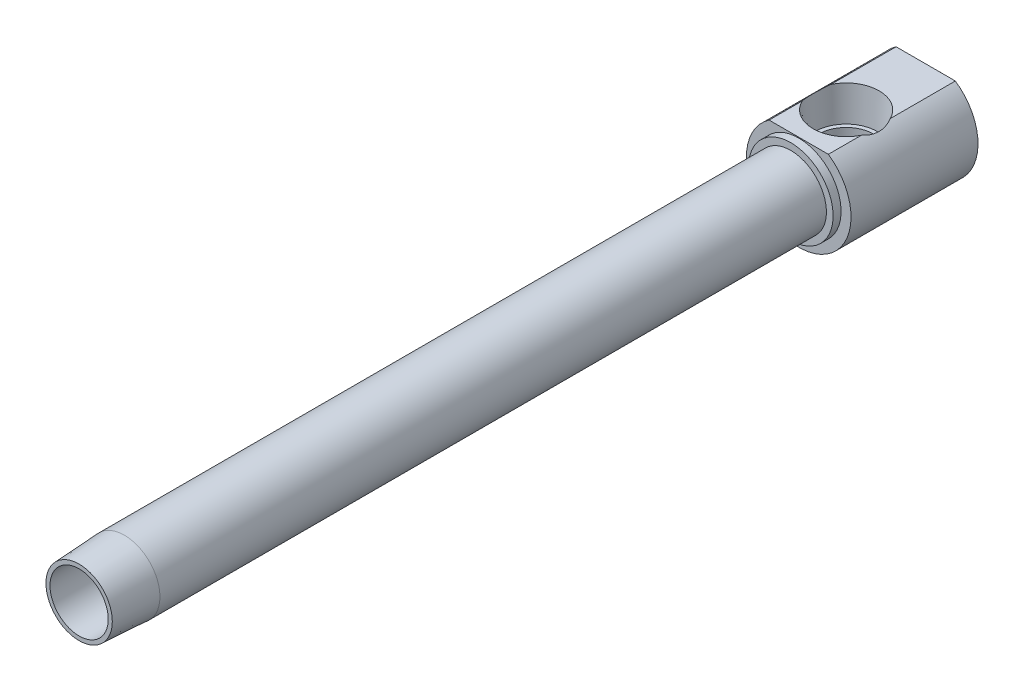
ISO-10303-21;
HEADER;
FILE_DESCRIPTION(('STEP AP214'),'2;1');
FILE_NAME('part.step','',(''),(''),'','','');
FILE_SCHEMA(('AUTOMOTIVE_DESIGN { 1 0 10303 214 1 1 1 1 }'));
ENDSEC;
DATA;
#1=APPLICATION_CONTEXT('core data for automotive mechanical design processes');
#2=APPLICATION_PROTOCOL_DEFINITION('international standard','automotive_design',2000,#1);
#3=PRODUCT_CONTEXT('',#1,'mechanical');
#4=PRODUCT('Part','Part','',(#3));
#5=PRODUCT_RELATED_PRODUCT_CATEGORY('part','',(#4));
#6=PRODUCT_DEFINITION_FORMATION('','',#4);
#7=PRODUCT_DEFINITION_CONTEXT('part definition',#1,'design');
#8=PRODUCT_DEFINITION('design','',#6,#7);
#9=PRODUCT_DEFINITION_SHAPE('','',#8);
#10=(LENGTH_UNIT() NAMED_UNIT(*) SI_UNIT(.MILLI.,.METRE.));
#11=(NAMED_UNIT(*) PLANE_ANGLE_UNIT() SI_UNIT($,.RADIAN.));
#12=(NAMED_UNIT(*) SI_UNIT($,.STERADIAN.) SOLID_ANGLE_UNIT());
#13=UNCERTAINTY_MEASURE_WITH_UNIT(LENGTH_MEASURE(1.E-05),#10,'distance_accuracy_value','');
#14=(GEOMETRIC_REPRESENTATION_CONTEXT(3) GLOBAL_UNCERTAINTY_ASSIGNED_CONTEXT((#13)) GLOBAL_UNIT_ASSIGNED_CONTEXT((#10,
#11,#12)) REPRESENTATION_CONTEXT('',''));
#15=CARTESIAN_POINT('',(0.,0.,0.));
#16=DIRECTION('',(0.,0.,1.));
#17=DIRECTION('',(1.,0.,0.));
#18=AXIS2_PLACEMENT_3D('',#15,#16,#17);
#19=CARTESIAN_POINT('',(0.,0.,-272.047166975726));
#20=DIRECTION('',(0.,0.,-1.));
#21=DIRECTION('',(-1.,0.,0.));
#22=AXIS2_PLACEMENT_3D('',#19,#20,#21);
#23=CYLINDRICAL_SURFACE('',#22,10.6883167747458);
#24=CARTESIAN_POINT('',(0.,0.,-213.5124));
#25=DIRECTION('',(0.,0.,-1.));
#26=DIRECTION('',(-1.,0.,0.));
#27=AXIS2_PLACEMENT_3D('',#24,#25,#26);
#28=CIRCLE('',#27,10.6883167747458);
#29=CARTESIAN_POINT('',(-10.6883167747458,0.,-213.5124));
#30=VERTEX_POINT('',#29);
#31=EDGE_CURVE('E143',#30,#30,#28,.T.);
#32=ORIENTED_EDGE('',*,*,#31,.F.);
#33=EDGE_LOOP('',(#32));
#34=FACE_BOUND('',#33,.T.);
#35=CARTESIAN_POINT('',(0.,0.,-13.5636));
#36=DIRECTION('',(0.,0.,1.));
#37=DIRECTION('',(1.,0.,0.));
#38=AXIS2_PLACEMENT_3D('',#35,#36,#37);
#39=CIRCLE('',#38,10.6883167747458);
#40=CARTESIAN_POINT('',(10.6883167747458,0.,-13.5636));
#41=VERTEX_POINT('',#40);
#42=EDGE_CURVE('E228',#41,#41,#39,.T.);
#43=ORIENTED_EDGE('',*,*,#42,.F.);
#44=EDGE_LOOP('',(#43));
#45=FACE_BOUND('',#44,.T.);
#46=ADVANCED_FACE('F15',(#34,#45),#23,.T.);
#47=CARTESIAN_POINT('',(-8.73125000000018,0.,0.));
#48=DIRECTION('',(0.,0.,1.));
#49=DIRECTION('',(1.,0.,0.));
#50=AXIS2_PLACEMENT_3D('',#47,#48,#49);
#51=PLANE('',#50);
#52=CARTESIAN_POINT('',(0.,0.,0.));
#53=DIRECTION('',(0.,0.,-1.));
#54=DIRECTION('',(-1.,0.,0.));
#55=AXIS2_PLACEMENT_3D('',#52,#53,#54);
#56=CIRCLE('',#55,8.73125000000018);
#57=CARTESIAN_POINT('',(-8.73125000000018,0.,0.));
#58=VERTEX_POINT('',#57);
#59=EDGE_CURVE('E19',#58,#58,#56,.T.);
#60=ORIENTED_EDGE('',*,*,#59,.T.);
#61=EDGE_LOOP('',(#60));
#62=FACE_BOUND('',#61,.T.);
#63=CARTESIAN_POINT('',(0.,0.,0.));
#64=DIRECTION('',(0.,0.,1.));
#65=DIRECTION('',(1.,0.,0.));
#66=AXIS2_PLACEMENT_3D('',#63,#64,#65);
#67=CIRCLE('',#66,9.9568);
#68=CARTESIAN_POINT('',(9.9568,0.,0.));
#69=VERTEX_POINT('',#68);
#70=EDGE_CURVE('E230',#69,#69,#67,.T.);
#71=ORIENTED_EDGE('',*,*,#70,.T.);
#72=EDGE_LOOP('',(#71));
#73=FACE_BOUND('',#72,.T.);
#74=ADVANCED_FACE('F17',(#62,#73),#51,.T.);
#75=CARTESIAN_POINT('',(-8.89,12.9217429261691,-196.85));
#76=DIRECTION('',(0.,-1.,0.));
#77=DIRECTION('',(0.,0.,-1.));
#78=AXIS2_PLACEMENT_3D('',#75,#76,#77);
#79=PLANE('',#78);
#80=DIRECTION('',(0.,0.,-1.));
#81=VECTOR('',#80,1.);
#82=CARTESIAN_POINT('',(8.89,12.9217429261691,-196.85));
#83=LINE('',#82,#81);
#84=CARTESIAN_POINT('',(8.89,12.9217429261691,-215.9));
#85=VERTEX_POINT('',#84);
#86=CARTESIAN_POINT('',(8.89,12.9217429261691,-225.798054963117));
#87=VERTEX_POINT('',#86);
#88=EDGE_CURVE('E127',#85,#87,#83,.T.);
#89=ORIENTED_EDGE('',*,*,#88,.T.);
#90=CARTESIAN_POINT('',(0.,12.9217429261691,-230.124));
#91=DIRECTION('',(0.,-1.,0.));
#92=DIRECTION('',(0.,0.,-1.));
#93=AXIS2_PLACEMENT_3D('',#90,#91,#92);
#94=CIRCLE('',#93,9.88665264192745);
#95=CARTESIAN_POINT('',(-8.89,12.9217429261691,-225.798054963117));
#96=VERTEX_POINT('',#95);
#97=EDGE_CURVE('E111',#87,#96,#94,.T.);
#98=ORIENTED_EDGE('',*,*,#97,.T.);
#99=DIRECTION('',(0.,0.,-1.));
#100=VECTOR('',#99,1.);
#101=CARTESIAN_POINT('',(-8.89,12.9217429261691,-196.85));
#102=LINE('',#101,#100);
#103=CARTESIAN_POINT('',(-8.89,12.9217429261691,-215.9));
#104=VERTEX_POINT('',#103);
#105=EDGE_CURVE('E138',#104,#96,#102,.T.);
#106=ORIENTED_EDGE('',*,*,#105,.F.);
#107=DIRECTION('',(1.,0.,0.));
#108=VECTOR('',#107,1.);
#109=CARTESIAN_POINT('',(-12.7,12.9217429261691,-215.9));
#110=LINE('',#109,#108);
#111=EDGE_CURVE('E135',#104,#85,#110,.T.);
#112=ORIENTED_EDGE('',*,*,#111,.T.);
#113=EDGE_LOOP('',(#89,#98,#106,#112));
#114=FACE_BOUND('',#113,.T.);
#115=ADVANCED_FACE('F133',(#114),#79,.F.);
#116=CARTESIAN_POINT('',(-8.73125000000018,0.,-213.927796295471));
#117=DIRECTION('',(0.,0.,1.));
#118=DIRECTION('',(1.,0.,0.));
#119=AXIS2_PLACEMENT_3D('',#116,#117,#118);
#120=PLANE('',#119);
#121=CARTESIAN_POINT('',(0.,0.,-213.927796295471));
#122=DIRECTION('',(0.,0.,-1.));
#123=DIRECTION('',(-1.,0.,0.));
#124=AXIS2_PLACEMENT_3D('',#121,#122,#123);
#125=CIRCLE('',#124,8.73125000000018);
#126=CARTESIAN_POINT('',(-8.73125000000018,0.,-213.927796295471));
#127=VERTEX_POINT('',#126);
#128=EDGE_CURVE('E157',#127,#127,#125,.T.);
#129=ORIENTED_EDGE('',*,*,#128,.F.);
#130=EDGE_LOOP('',(#129));
#131=FACE_BOUND('',#130,.T.);
#132=CARTESIAN_POINT('',(0.,-1.53831558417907,-213.927796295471));
#133=DIRECTION('',(0.,0.,1.));
#134=DIRECTION('',(0.,1.,0.));
#135=AXIS2_PLACEMENT_3D('',#132,#133,#134);
#136=ELLIPSE('',#135,7.0682508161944,6.80767250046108);
#137=CARTESIAN_POINT('',(0.,5.52993523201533,-213.927796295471));
#138=VERTEX_POINT('',#137);
#139=EDGE_CURVE('E162',#138,#138,#136,.F.);
#140=ORIENTED_EDGE('',*,*,#139,.T.);
#141=EDGE_LOOP('',(#140));
#142=FACE_BOUND('',#141,.T.);
#143=ADVANCED_FACE('F211',(#131,#142),#120,.T.);
#144=CARTESIAN_POINT('',(0.,0.,-272.047166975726));
#145=DIRECTION('',(0.,0.,-1.));
#146=DIRECTION('',(-1.,0.,0.));
#147=AXIS2_PLACEMENT_3D('',#144,#145,#146);
#148=CYLINDRICAL_SURFACE('',#147,8.73125000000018);
#149=ORIENTED_EDGE('',*,*,#128,.T.);
#150=EDGE_LOOP('',(#149));
#151=FACE_BOUND('',#150,.T.);
#152=ORIENTED_EDGE('',*,*,#59,.F.);
#153=EDGE_LOOP('',(#152));
#154=FACE_BOUND('',#153,.T.);
#155=ADVANCED_FACE('F209',(#151,#154),#148,.F.);
#156=CARTESIAN_POINT('',(-15.6845,0.,-254.));
#157=DIRECTION('',(0.,0.,-1.));
#158=DIRECTION('',(-1.,0.,0.));
#159=AXIS2_PLACEMENT_3D('',#156,#157,#158);
#160=PLANE('',#159);
#161=DIRECTION('',(1.,0.,0.));
#162=VECTOR('',#161,1.);
#163=CARTESIAN_POINT('',(-3.66617420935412,6.35,-254.));
#164=LINE('',#163,#162);
#165=CARTESIAN_POINT('',(-3.66617420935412,6.35,-254.));
#166=VERTEX_POINT('',#165);
#167=CARTESIAN_POINT('',(3.66617420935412,6.35,-254.));
#168=VERTEX_POINT('',#167);
#169=EDGE_CURVE('E165',#166,#168,#164,.T.);
#170=ORIENTED_EDGE('',*,*,#169,.F.);
#171=DIRECTION('',(0.5,0.866025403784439,0.));
#172=VECTOR('',#171,1.);
#173=CARTESIAN_POINT('',(-7.33234841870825,0.,-254.));
#174=LINE('',#173,#172);
#175=CARTESIAN_POINT('',(-7.33234841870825,0.,-254.));
#176=VERTEX_POINT('',#175);
#177=EDGE_CURVE('E282',#176,#166,#174,.T.);
#178=ORIENTED_EDGE('',*,*,#177,.F.);
#179=DIRECTION('',(-0.5,0.866025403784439,0.));
#180=VECTOR('',#179,1.);
#181=CARTESIAN_POINT('',(-3.66617420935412,-6.35,-254.));
#182=LINE('',#181,#180);
#183=CARTESIAN_POINT('',(-3.66617420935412,-6.35,-254.));
#184=VERTEX_POINT('',#183);
#185=EDGE_CURVE('E308',#184,#176,#182,.T.);
#186=ORIENTED_EDGE('',*,*,#185,.F.);
#187=DIRECTION('',(-1.,0.,0.));
#188=VECTOR('',#187,1.);
#189=CARTESIAN_POINT('',(3.66617420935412,-6.35,-254.));
#190=LINE('',#189,#188);
#191=CARTESIAN_POINT('',(3.66617420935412,-6.35,-254.));
#192=VERTEX_POINT('',#191);
#193=EDGE_CURVE('E305',#192,#184,#190,.T.);
#194=ORIENTED_EDGE('',*,*,#193,.F.);
#195=DIRECTION('',(-0.5,-0.866025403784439,0.));
#196=VECTOR('',#195,1.);
#197=CARTESIAN_POINT('',(7.33234841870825,0.,-254.));
#198=LINE('',#197,#196);
#199=CARTESIAN_POINT('',(7.33234841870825,0.,-254.));
#200=VERTEX_POINT('',#199);
#201=EDGE_CURVE('E302',#200,#192,#198,.T.);
#202=ORIENTED_EDGE('',*,*,#201,.F.);
#203=DIRECTION('',(0.5,-0.866025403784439,0.));
#204=VECTOR('',#203,1.);
#205=CARTESIAN_POINT('',(3.66617420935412,6.35,-254.));
#206=LINE('',#205,#204);
#207=EDGE_CURVE('E299',#168,#200,#206,.T.);
#208=ORIENTED_EDGE('',*,*,#207,.F.);
#209=EDGE_LOOP('',(#170,#178,#186,#194,#202,#208));
#210=FACE_BOUND('',#209,.T.);
#211=DIRECTION('',(-1.,0.,0.));
#212=VECTOR('',#211,1.);
#213=CARTESIAN_POINT('',(-8.89,12.9217429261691,-254.));
#214=LINE('',#213,#212);
#215=CARTESIAN_POINT('',(8.89,12.9217429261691,-254.));
#216=VERTEX_POINT('',#215);
#217=CARTESIAN_POINT('',(-8.89,12.9217429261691,-254.));
#218=VERTEX_POINT('',#217);
#219=EDGE_CURVE('E140',#216,#218,#214,.T.);
#220=ORIENTED_EDGE('',*,*,#219,.F.);
#221=CARTESIAN_POINT('',(0.,0.,-254.));
#222=DIRECTION('',(0.,0.,-1.));
#223=DIRECTION('',(-1.,0.,0.));
#224=AXIS2_PLACEMENT_3D('',#221,#222,#223);
#225=CIRCLE('',#224,15.6845);
#226=EDGE_CURVE('E154',#216,#218,#225,.T.);
#227=ORIENTED_EDGE('',*,*,#226,.T.);
#228=EDGE_LOOP('',(#220,#227));
#229=FACE_BOUND('',#228,.T.);
#230=ADVANCED_FACE('F204',(#210,#229),#160,.T.);
#231=CARTESIAN_POINT('',(0.,0.,-272.047166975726));
#232=DIRECTION('',(0.,0.,-1.));
#233=DIRECTION('',(-1.,0.,0.));
#234=AXIS2_PLACEMENT_3D('',#231,#232,#233);
#235=CYLINDRICAL_SURFACE('',#234,15.6845);
#236=CARTESIAN_POINT('',(6.18126199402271,14.4151149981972,-222.307890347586));
#237=CARTESIAN_POINT('',(6.40820210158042,14.317827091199,-222.493892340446));
#238=CARTESIAN_POINT('',(6.6261718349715,14.2179923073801,-222.689429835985));
#239=CARTESIAN_POINT('',(7.04356392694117,14.015896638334,-223.098561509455));
#240=CARTESIAN_POINT('',(7.24297338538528,13.9136341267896,-223.312168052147));
#241=CARTESIAN_POINT('',(7.62085258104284,13.7102837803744,-223.754442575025));
#242=CARTESIAN_POINT('',(7.79947267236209,13.6091929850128,-223.982980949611));
#243=CARTESIAN_POINT('',(8.13667540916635,13.4103063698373,-224.455534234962));
#244=CARTESIAN_POINT('',(8.29527210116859,13.3125082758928,-224.699538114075));
#245=CARTESIAN_POINT('',(8.52405372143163,13.1663669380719,-225.087604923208));
#246=CARTESIAN_POINT('',(8.60159506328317,13.1157948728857,-225.226544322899));
#247=CARTESIAN_POINT('',(8.75042416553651,13.0169736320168,-225.508789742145));
#248=CARTESIAN_POINT('',(8.82170394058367,12.9687274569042,-225.65210103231));
#249=CARTESIAN_POINT('',(8.98942344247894,12.85334420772,-226.010530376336));
#250=CARTESIAN_POINT('',(9.08209775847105,12.7878879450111,-226.227972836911));
#251=CARTESIAN_POINT('',(9.25265845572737,12.6650269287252,-226.670791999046));
#252=CARTESIAN_POINT('',(9.33054529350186,12.6076219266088,-226.896168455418));
#253=CARTESIAN_POINT('',(9.47086217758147,12.5025600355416,-227.354136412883));
#254=CARTESIAN_POINT('',(9.53327990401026,12.4549109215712,-227.586733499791));
#255=CARTESIAN_POINT('',(9.64181076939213,12.3710847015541,-228.057621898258));
#256=CARTESIAN_POINT('',(9.68793245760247,12.3349015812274,-228.295910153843));
#257=CARTESIAN_POINT('',(9.76349281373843,12.2751820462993,-228.778204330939));
#258=CARTESIAN_POINT('',(9.7928289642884,12.2517233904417,-229.022236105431));
#259=CARTESIAN_POINT('',(9.83390591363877,12.2187780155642,-229.512731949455));
#260=CARTESIAN_POINT('',(9.84564637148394,12.2092915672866,-229.759196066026));
#261=CARTESIAN_POINT('',(9.85132494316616,12.2047101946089,-230.252460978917));
#262=CARTESIAN_POINT('',(9.84526326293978,12.2096151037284,-230.499261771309));
#263=CARTESIAN_POINT('',(9.81544491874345,12.233598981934,-230.991077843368));
#264=CARTESIAN_POINT('',(9.79168936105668,12.2526770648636,-231.236093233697));
#265=CARTESIAN_POINT('',(9.7294701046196,12.3021291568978,-231.703007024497));
#266=CARTESIAN_POINT('',(9.69232783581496,12.3314830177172,-231.925192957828));
#267=CARTESIAN_POINT('',(9.60385268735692,12.400512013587,-232.365181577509));
#268=CARTESIAN_POINT('',(9.55251354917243,12.4401917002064,-232.582982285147));
#269=CARTESIAN_POINT('',(9.43631194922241,12.5285621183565,-233.012660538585));
#270=CARTESIAN_POINT('',(9.37147123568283,12.5772383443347,-233.224546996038));
#271=CARTESIAN_POINT('',(9.22879623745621,12.6822986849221,-233.641936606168));
#272=CARTESIAN_POINT('',(9.1509619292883,12.7386828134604,-233.847439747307));
#273=CARTESIAN_POINT('',(9.01061877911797,12.838109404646,-234.184726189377));
#274=CARTESIAN_POINT('',(8.95152353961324,12.8794177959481,-234.318466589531));
#275=CARTESIAN_POINT('',(8.76461266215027,13.0080031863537,-234.717903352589));
#276=CARTESIAN_POINT('',(8.62838014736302,13.0990466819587,-234.978521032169));
#277=CARTESIAN_POINT('',(8.33484719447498,13.2877507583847,-235.485122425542));
#278=CARTESIAN_POINT('',(8.17753852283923,13.385413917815,-235.731100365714));
#279=CARTESIAN_POINT('',(7.84238437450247,13.5844995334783,-236.2080815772));
#280=CARTESIAN_POINT('',(7.66448703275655,13.685931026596,-236.439044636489));
#281=CARTESIAN_POINT('',(7.28939666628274,13.8893391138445,-236.884214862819));
#282=CARTESIAN_POINT('',(7.09221474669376,13.9913153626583,-237.098431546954));
#283=CARTESIAN_POINT('',(6.68803601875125,14.1888008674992,-237.500395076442));
#284=CARTESIAN_POINT('',(6.48182024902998,14.2844001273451,-237.688882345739));
#285=CARTESIAN_POINT('',(6.05384699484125,14.4709681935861,-238.047789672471));
#286=CARTESIAN_POINT('',(5.8321545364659,14.5619538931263,-238.218278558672));
#287=CARTESIAN_POINT('',(5.60267382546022,14.6496957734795,-238.379590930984));
#288=B_SPLINE_CURVE_WITH_KNOTS('',3,(#236,#237,#238,#239,#240,#241,#242,#243,#244,#245,#246,
#247,#248,#249,#250,#251,#252,#253,#254,#255,#256,#257,#258,#259,#260,#261,#262,#263,#264,#265,
#266,#267,#268,#269,#270,#271,#272,#273,#274,#275,#276,#277,#278,#279,#280,#281,#282,#283,#284,
#285,#286,#287),.UNSPECIFIED.,.F.,.F.,(4,2,2,2,2,2,2,2,2,2,2,2,2,2,2,2,2,2,2,2,2,2,2,2,2,4),(0.,
0.927053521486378,1.85474664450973,2.77524763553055,3.69509925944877,4.19580328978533,
4.69713686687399,5.43222687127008,6.16729417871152,6.90294503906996,7.63820938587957,
8.37791768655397,9.11764032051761,9.8573543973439,10.5970222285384,11.2778067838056,
11.9588919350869,12.6388883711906,13.3188860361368,13.7745816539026,14.6967959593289,
15.6193715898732,16.5443240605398,17.4687469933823,18.3536130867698,19.2349623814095),.UNSPECIFIED.);
#289=CARTESIAN_POINT('',(8.89,12.9217429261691,-234.449945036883));
#290=VERTEX_POINT('',#289);
#291=EDGE_CURVE('E31',#87,#290,#288,.T.);
#292=ORIENTED_EDGE('',*,*,#291,.F.);
#293=ORIENTED_EDGE('',*,*,#88,.F.);
#294=CARTESIAN_POINT('',(0.,0.,-215.9));
#295=DIRECTION('',(0.,0.,-1.));
#296=DIRECTION('',(-1.,0.,0.));
#297=AXIS2_PLACEMENT_3D('',#294,#295,#296);
#298=CIRCLE('',#297,15.6845);
#299=EDGE_CURVE('E152',#85,#104,#298,.T.);
#300=ORIENTED_EDGE('',*,*,#299,.T.);
#301=ORIENTED_EDGE('',*,*,#105,.T.);
#302=CARTESIAN_POINT('',(-5.60267382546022,14.6496957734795,-238.379590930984));
#303=CARTESIAN_POINT('',(-5.83916916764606,14.5592741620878,-238.213346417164));
#304=CARTESIAN_POINT('',(-6.06739391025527,14.4654038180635,-238.037356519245));
#305=CARTESIAN_POINT('',(-6.50657666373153,14.2732361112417,-237.667106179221));
#306=CARTESIAN_POINT('',(-6.71753229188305,14.1749381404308,-237.472843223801));
#307=CARTESIAN_POINT('',(-7.12045557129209,13.9768691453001,-237.06824748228));
#308=CARTESIAN_POINT('',(-7.31250621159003,13.8771069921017,-236.857992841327));
#309=CARTESIAN_POINT('',(-7.67797599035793,13.6782845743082,-236.421703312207));
#310=CARTESIAN_POINT('',(-7.851401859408,13.5792240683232,-236.195674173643));
#311=CARTESIAN_POINT('',(-8.18139016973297,13.3830412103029,-235.725173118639));
#312=CARTESIAN_POINT('',(-8.33766306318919,13.2859696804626,-235.480476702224));
#313=CARTESIAN_POINT('',(-8.6295458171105,13.0982677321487,-234.976292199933));
#314=CARTESIAN_POINT('',(-8.76513502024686,13.0076438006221,-234.716789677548));
#315=CARTESIAN_POINT('',(-8.98947377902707,12.8533099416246,-234.237363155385));
#316=CARTESIAN_POINT('',(-9.08217383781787,12.7878343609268,-234.019849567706));
#317=CARTESIAN_POINT('',(-9.25276992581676,12.6649454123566,-233.576898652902));
#318=CARTESIAN_POINT('',(-9.33066889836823,12.6075304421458,-233.351462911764));
#319=CARTESIAN_POINT('',(-9.47096094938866,12.5024850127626,-232.893506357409));
#320=CARTESIAN_POINT('',(-9.53335030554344,12.4548569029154,-232.66098385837));
#321=CARTESIAN_POINT('',(-9.64183755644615,12.3710636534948,-232.190239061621));
#322=CARTESIAN_POINT('',(-9.68794342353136,12.3348929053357,-231.952019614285));
#323=CARTESIAN_POINT('',(-9.76349062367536,12.2751837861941,-231.469809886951));
#324=CARTESIAN_POINT('',(-9.79282550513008,12.2517261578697,-231.225792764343));
#325=CARTESIAN_POINT('',(-9.83390185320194,12.2187812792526,-230.735328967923));
#326=CARTESIAN_POINT('',(-9.84564316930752,12.2092941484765,-230.488882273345));
#327=CARTESIAN_POINT('',(-9.85132631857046,12.2047090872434,-229.995619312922));
#328=CARTESIAN_POINT('',(-9.84526600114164,12.2096128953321,-229.748803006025));
#329=CARTESIAN_POINT('',(-9.81544809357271,12.2335964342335,-229.256954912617));
#330=CARTESIAN_POINT('',(-9.79169153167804,12.2526753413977,-229.011923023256));
#331=CARTESIAN_POINT('',(-9.72947134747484,12.3021281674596,-228.545002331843));
#332=CARTESIAN_POINT('',(-9.69233092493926,12.3314805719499,-228.322825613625));
#333=CARTESIAN_POINT('',(-9.60386128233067,12.4005053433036,-227.882857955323));
#334=CARTESIAN_POINT('',(-9.55252598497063,12.4401821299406,-227.6650689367));
#335=CARTESIAN_POINT('',(-9.43632738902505,12.5285504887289,-227.23539132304));
#336=CARTESIAN_POINT('',(-9.37148448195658,12.5772284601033,-227.023494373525));
#337=CARTESIAN_POINT('',(-9.22880457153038,12.6822926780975,-226.606085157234));
#338=CARTESIAN_POINT('',(-9.15096746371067,12.7386789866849,-226.400572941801));
#339=CARTESIAN_POINT('',(-9.01061796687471,12.8381099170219,-226.063272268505));
#340=CARTESIAN_POINT('',(-8.95152097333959,12.8794194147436,-225.929528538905));
#341=CARTESIAN_POINT('',(-8.80068775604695,12.9831855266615,-225.607189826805));
#342=CARTESIAN_POINT('',(-8.70603543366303,13.0469462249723,-225.420366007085));
#343=CARTESIAN_POINT('',(-8.50583150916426,13.1783430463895,-225.053845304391));
#344=CARTESIAN_POINT('',(-8.40026939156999,13.2459828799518,-224.874155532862));
#345=CARTESIAN_POINT('',(-8.14693598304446,13.403699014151,-224.472018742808));
#346=CARTESIAN_POINT('',(-7.99573471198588,13.4946529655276,-224.252065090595));
#347=CARTESIAN_POINT('',(-7.67663330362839,13.6786987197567,-223.825415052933));
#348=CARTESIAN_POINT('',(-7.50872479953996,13.7717915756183,-223.618725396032));
#349=CARTESIAN_POINT('',(-7.15655125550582,13.9580450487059,-223.219106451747));
#350=CARTESIAN_POINT('',(-6.97225920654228,14.0512055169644,-223.026200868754));
#351=CARTESIAN_POINT('',(-6.58822039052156,14.2353204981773,-222.655512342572));
#352=CARTESIAN_POINT('',(-6.38848080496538,14.3262760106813,-222.477722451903));
#353=CARTESIAN_POINT('',(-6.18126199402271,14.4151149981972,-222.307890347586));
#354=B_SPLINE_CURVE_WITH_KNOTS('',3,(#302,#303,#304,#305,#306,#307,#308,#309,#310,#311,#312,
#313,#314,#315,#316,#317,#318,#319,#320,#321,#322,#323,#324,#325,#326,#327,#328,#329,#330,#331,
#332,#333,#334,#335,#336,#337,#338,#339,#340,#341,#342,#343,#344,#345,#346,#347,#348,#349,#350,
#351,#352,#353),.UNSPECIFIED.,.F.,.F.,(4,2,2,2,2,2,2,2,2,2,2,2,2,2,2,2,2,2,2,2,2,2,2,2,2,4),(0.,
0.908274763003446,1.8166746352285,2.72089010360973,3.62477770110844,4.54212421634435,
5.46038099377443,6.19576092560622,6.93099446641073,7.66640429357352,8.40145356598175,
9.14111809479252,9.88078895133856,10.6205491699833,11.3602664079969,12.0410224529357,
12.7220704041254,13.4020975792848,14.0821302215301,14.5378258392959,15.1941212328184,
15.8510552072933,16.6961350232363,17.5416401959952,18.3885660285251,19.2351004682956),.UNSPECIFIED.);
#355=CARTESIAN_POINT('',(-8.89,12.9217429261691,-234.449945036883));
#356=VERTEX_POINT('',#355);
#357=EDGE_CURVE('E115',#356,#96,#354,.T.);
#358=ORIENTED_EDGE('',*,*,#357,.F.);
#359=EDGE_CURVE('E136',#356,#218,#102,.T.);
#360=ORIENTED_EDGE('',*,*,#359,.T.);
#361=ORIENTED_EDGE('',*,*,#226,.F.);
#362=EDGE_CURVE('E130',#290,#216,#83,.T.);
#363=ORIENTED_EDGE('',*,*,#362,.F.);
#364=EDGE_LOOP('',(#292,#293,#300,#301,#358,#360,#361,#363));
#365=FACE_BOUND('',#364,.T.);
#366=ADVANCED_FACE('F125',(#365),#235,.T.);
#367=CARTESIAN_POINT('',(-12.7,0.,-215.9));
#368=DIRECTION('',(0.,0.,1.));
#369=DIRECTION('',(1.,0.,0.));
#370=AXIS2_PLACEMENT_3D('',#367,#368,#369);
#371=PLANE('',#370);
#372=ORIENTED_EDGE('',*,*,#111,.F.);
#373=ORIENTED_EDGE('',*,*,#299,.F.);
#374=EDGE_LOOP('',(#372,#373));
#375=FACE_BOUND('',#374,.T.);
#376=CARTESIAN_POINT('',(0.,0.,-215.9));
#377=DIRECTION('',(0.,0.,-1.));
#378=DIRECTION('',(-1.,0.,0.));
#379=AXIS2_PLACEMENT_3D('',#376,#377,#378);
#380=CIRCLE('',#379,12.7);
#381=CARTESIAN_POINT('',(-12.7,0.,-215.9));
#382=VERTEX_POINT('',#381);
#383=EDGE_CURVE('E149',#382,#382,#380,.T.);
#384=ORIENTED_EDGE('',*,*,#383,.T.);
#385=EDGE_LOOP('',(#384));
#386=FACE_BOUND('',#385,.T.);
#387=ADVANCED_FACE('F203',(#375,#386),#371,.T.);
#388=CARTESIAN_POINT('',(0.,0.,-272.047166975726));
#389=DIRECTION('',(0.,0.,-1.));
#390=DIRECTION('',(-1.,0.,0.));
#391=AXIS2_PLACEMENT_3D('',#388,#389,#390);
#392=CYLINDRICAL_SURFACE('',#391,12.7);
#393=CARTESIAN_POINT('',(0.,0.,-213.5124));
#394=DIRECTION('',(0.,0.,-1.));
#395=DIRECTION('',(-1.,0.,0.));
#396=AXIS2_PLACEMENT_3D('',#393,#394,#395);
#397=CIRCLE('',#396,12.7);
#398=CARTESIAN_POINT('',(-12.7,0.,-213.5124));
#399=VERTEX_POINT('',#398);
#400=EDGE_CURVE('E146',#399,#399,#397,.T.);
#401=ORIENTED_EDGE('',*,*,#400,.T.);
#402=EDGE_LOOP('',(#401));
#403=FACE_BOUND('',#402,.T.);
#404=ORIENTED_EDGE('',*,*,#383,.F.);
#405=EDGE_LOOP('',(#404));
#406=FACE_BOUND('',#405,.T.);
#407=ADVANCED_FACE('F333',(#403,#406),#392,.T.);
#408=CARTESIAN_POINT('',(-10.6883167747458,0.,-213.5124));
#409=DIRECTION('',(0.,0.,1.));
#410=DIRECTION('',(1.,0.,0.));
#411=AXIS2_PLACEMENT_3D('',#408,#409,#410);
#412=PLANE('',#411);
#413=ORIENTED_EDGE('',*,*,#31,.T.);
#414=EDGE_LOOP('',(#413));
#415=FACE_BOUND('',#414,.T.);
#416=ORIENTED_EDGE('',*,*,#400,.F.);
#417=EDGE_LOOP('',(#416));
#418=FACE_BOUND('',#417,.T.);
#419=ADVANCED_FACE('F337',(#415,#418),#412,.T.);
#420=ORIENTED_EDGE('',*,*,#359,.F.);
#421=EDGE_CURVE('E120',#356,#290,#94,.T.);
#422=ORIENTED_EDGE('',*,*,#421,.T.);
#423=ORIENTED_EDGE('',*,*,#362,.T.);
#424=ORIENTED_EDGE('',*,*,#219,.T.);
#425=EDGE_LOOP('',(#420,#422,#423,#424));
#426=FACE_BOUND('',#425,.T.);
#427=ADVANCED_FACE('F328',(#426),#79,.F.);
#428=CARTESIAN_POINT('',(-3.66617420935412,6.35,-247.65));
#429=DIRECTION('',(0.,1.,0.));
#430=DIRECTION('',(-1.,0.,0.));
#431=AXIS2_PLACEMENT_3D('',#428,#429,#430);
#432=PLANE('',#431);
#433=ORIENTED_EDGE('',*,*,#169,.T.);
#434=DIRECTION('',(0.,0.,-1.));
#435=VECTOR('',#434,1.);
#436=CARTESIAN_POINT('',(3.66617420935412,6.35,-247.65));
#437=LINE('',#436,#435);
#438=CARTESIAN_POINT('',(3.66617420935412,6.35,-247.65));
#439=VERTEX_POINT('',#438);
#440=EDGE_CURVE('E297',#439,#168,#437,.T.);
#441=ORIENTED_EDGE('',*,*,#440,.F.);
#442=DIRECTION('',(1.,0.,0.));
#443=VECTOR('',#442,1.);
#444=CARTESIAN_POINT('',(-3.66617420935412,6.35,-247.65));
#445=LINE('',#444,#443);
#446=CARTESIAN_POINT('',(-3.66617420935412,6.35,-247.65));
#447=VERTEX_POINT('',#446);
#448=EDGE_CURVE('E278',#447,#439,#445,.T.);
#449=ORIENTED_EDGE('',*,*,#448,.F.);
#450=DIRECTION('',(0.,0.,-1.));
#451=VECTOR('',#450,1.);
#452=CARTESIAN_POINT('',(-3.66617420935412,6.35,-247.65));
#453=LINE('',#452,#451);
#454=EDGE_CURVE('E313',#447,#166,#453,.T.);
#455=ORIENTED_EDGE('',*,*,#454,.T.);
#456=EDGE_LOOP('',(#433,#441,#449,#455));
#457=FACE_BOUND('',#456,.T.);
#458=ADVANCED_FACE('F347',(#457),#432,.F.);
#459=CARTESIAN_POINT('',(-7.33234841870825,0.,-247.65));
#460=DIRECTION('',(-0.866025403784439,0.5,0.));
#461=DIRECTION('',(-0.5,-0.866025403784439,0.));
#462=AXIS2_PLACEMENT_3D('',#459,#460,#461);
#463=PLANE('',#462);
#464=ORIENTED_EDGE('',*,*,#177,.T.);
#465=ORIENTED_EDGE('',*,*,#454,.F.);
#466=DIRECTION('',(0.5,0.866025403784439,0.));
#467=VECTOR('',#466,1.);
#468=CARTESIAN_POINT('',(-7.33234841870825,0.,-247.65));
#469=LINE('',#468,#467);
#470=CARTESIAN_POINT('',(-7.33234841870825,0.,-247.65));
#471=VERTEX_POINT('',#470);
#472=EDGE_CURVE('E294',#471,#447,#469,.T.);
#473=ORIENTED_EDGE('',*,*,#472,.F.);
#474=DIRECTION('',(0.,0.,-1.));
#475=VECTOR('',#474,1.);
#476=CARTESIAN_POINT('',(-7.33234841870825,0.,-247.65));
#477=LINE('',#476,#475);
#478=EDGE_CURVE('E315',#471,#176,#477,.T.);
#479=ORIENTED_EDGE('',*,*,#478,.T.);
#480=EDGE_LOOP('',(#464,#465,#473,#479));
#481=FACE_BOUND('',#480,.T.);
#482=ADVANCED_FACE('F350',(#481),#463,.F.);
#483=CARTESIAN_POINT('',(-3.66617420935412,-6.35,-247.65));
#484=DIRECTION('',(-0.866025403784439,-0.5,0.));
#485=DIRECTION('',(0.5,-0.866025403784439,0.));
#486=AXIS2_PLACEMENT_3D('',#483,#484,#485);
#487=PLANE('',#486);
#488=ORIENTED_EDGE('',*,*,#185,.T.);
#489=ORIENTED_EDGE('',*,*,#478,.F.);
#490=DIRECTION('',(-0.5,0.866025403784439,0.));
#491=VECTOR('',#490,1.);
#492=CARTESIAN_POINT('',(-3.66617420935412,-6.35,-247.65));
#493=LINE('',#492,#491);
#494=CARTESIAN_POINT('',(-3.66617420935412,-6.35,-247.65));
#495=VERTEX_POINT('',#494);
#496=EDGE_CURVE('E291',#495,#471,#493,.T.);
#497=ORIENTED_EDGE('',*,*,#496,.F.);
#498=DIRECTION('',(0.,0.,-1.));
#499=VECTOR('',#498,1.);
#500=CARTESIAN_POINT('',(-3.66617420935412,-6.35,-247.65));
#501=LINE('',#500,#499);
#502=EDGE_CURVE('E317',#495,#184,#501,.T.);
#503=ORIENTED_EDGE('',*,*,#502,.T.);
#504=EDGE_LOOP('',(#488,#489,#497,#503));
#505=FACE_BOUND('',#504,.T.);
#506=ADVANCED_FACE('F364',(#505),#487,.F.);
#507=CARTESIAN_POINT('',(3.66617420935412,-6.35,-247.65));
#508=DIRECTION('',(0.,-1.,0.));
#509=DIRECTION('',(1.,0.,0.));
#510=AXIS2_PLACEMENT_3D('',#507,#508,#509);
#511=PLANE('',#510);
#512=ORIENTED_EDGE('',*,*,#193,.T.);
#513=ORIENTED_EDGE('',*,*,#502,.F.);
#514=DIRECTION('',(-1.,0.,0.));
#515=VECTOR('',#514,1.);
#516=CARTESIAN_POINT('',(3.66617420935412,-6.35,-247.65));
#517=LINE('',#516,#515);
#518=CARTESIAN_POINT('',(3.66617420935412,-6.35,-247.65));
#519=VERTEX_POINT('',#518);
#520=EDGE_CURVE('E288',#519,#495,#517,.T.);
#521=ORIENTED_EDGE('',*,*,#520,.F.);
#522=DIRECTION('',(0.,0.,-1.));
#523=VECTOR('',#522,1.);
#524=CARTESIAN_POINT('',(3.66617420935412,-6.35,-247.65));
#525=LINE('',#524,#523);
#526=EDGE_CURVE('E319',#519,#192,#525,.T.);
#527=ORIENTED_EDGE('',*,*,#526,.T.);
#528=EDGE_LOOP('',(#512,#513,#521,#527));
#529=FACE_BOUND('',#528,.T.);
#530=ADVANCED_FACE('F360',(#529),#511,.F.);
#531=CARTESIAN_POINT('',(7.33234841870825,0.,-247.65));
#532=DIRECTION('',(0.866025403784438,-0.5,0.));
#533=DIRECTION('',(0.5,0.866025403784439,0.));
#534=AXIS2_PLACEMENT_3D('',#531,#532,#533);
#535=PLANE('',#534);
#536=ORIENTED_EDGE('',*,*,#201,.T.);
#537=ORIENTED_EDGE('',*,*,#526,.F.);
#538=DIRECTION('',(-0.5,-0.866025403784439,0.));
#539=VECTOR('',#538,1.);
#540=CARTESIAN_POINT('',(7.33234841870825,0.,-247.65));
#541=LINE('',#540,#539);
#542=CARTESIAN_POINT('',(7.33234841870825,0.,-247.65));
#543=VERTEX_POINT('',#542);
#544=EDGE_CURVE('E285',#543,#519,#541,.T.);
#545=ORIENTED_EDGE('',*,*,#544,.F.);
#546=DIRECTION('',(0.,0.,-1.));
#547=VECTOR('',#546,1.);
#548=CARTESIAN_POINT('',(7.33234841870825,0.,-247.65));
#549=LINE('',#548,#547);
#550=EDGE_CURVE('E321',#543,#200,#549,.T.);
#551=ORIENTED_EDGE('',*,*,#550,.T.);
#552=EDGE_LOOP('',(#536,#537,#545,#551));
#553=FACE_BOUND('',#552,.T.);
#554=ADVANCED_FACE('F356',(#553),#535,.F.);
#555=CARTESIAN_POINT('',(3.66617420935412,6.35,-247.65));
#556=DIRECTION('',(0.866025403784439,0.5,0.));
#557=DIRECTION('',(-0.5,0.866025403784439,0.));
#558=AXIS2_PLACEMENT_3D('',#555,#556,#557);
#559=PLANE('',#558);
#560=ORIENTED_EDGE('',*,*,#207,.T.);
#561=ORIENTED_EDGE('',*,*,#550,.F.);
#562=DIRECTION('',(0.5,-0.866025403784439,0.));
#563=VECTOR('',#562,1.);
#564=CARTESIAN_POINT('',(3.66617420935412,6.35,-247.65));
#565=LINE('',#564,#563);
#566=EDGE_CURVE('E281',#439,#543,#565,.T.);
#567=ORIENTED_EDGE('',*,*,#566,.F.);
#568=ORIENTED_EDGE('',*,*,#440,.T.);
#569=EDGE_LOOP('',(#560,#561,#567,#568));
#570=FACE_BOUND('',#569,.T.);
#571=ADVANCED_FACE('F352',(#570),#559,.F.);
#572=CARTESIAN_POINT('',(0.,0.,-247.65));
#573=DIRECTION('',(0.,0.,-1.));
#574=DIRECTION('',(-1.,0.,0.));
#575=AXIS2_PLACEMENT_3D('',#572,#573,#574);
#576=PLANE('',#575);
#577=ORIENTED_EDGE('',*,*,#448,.T.);
#578=ORIENTED_EDGE('',*,*,#566,.T.);
#579=ORIENTED_EDGE('',*,*,#544,.T.);
#580=ORIENTED_EDGE('',*,*,#520,.T.);
#581=ORIENTED_EDGE('',*,*,#496,.T.);
#582=ORIENTED_EDGE('',*,*,#472,.T.);
#583=EDGE_LOOP('',(#577,#578,#579,#580,#581,#582));
#584=FACE_BOUND('',#583,.T.);
#585=ADVANCED_FACE('F355',(#584),#576,.T.);
#586=CARTESIAN_POINT('',(0.,-6.16022605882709,-229.784880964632));
#587=DIRECTION('',(0.,0.267292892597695,0.963615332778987));
#588=DIRECTION('',(0.,-0.963615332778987,0.267292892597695));
#589=AXIS2_PLACEMENT_3D('',#586,#587,#588);
#590=CONICAL_SURFACE('',#589,4.92936747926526,0.794181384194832);
#591=CARTESIAN_POINT('',(-4.92956747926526,-6.70529941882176,-229.599424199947));
#592=CARTESIAN_POINT('',(-4.86454849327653,-6.74578087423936,-229.651070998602));
#593=CARTESIAN_POINT('',(-4.79934438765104,-6.78602416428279,-229.702671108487));
#594=CARTESIAN_POINT('',(-4.66853190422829,-6.86595614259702,-229.805790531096));
#595=CARTESIAN_POINT('',(-4.60292352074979,-6.90564482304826,-229.857309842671));
#596=CARTESIAN_POINT('',(-4.40534693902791,-7.02381768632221,-230.011838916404));
#597=CARTESIAN_POINT('',(-4.27272274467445,-7.10134897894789,-230.11474396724));
#598=CARTESIAN_POINT('',(-4.00251092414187,-7.25460162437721,-230.322758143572));
#599=CARTESIAN_POINT('',(-3.86487828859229,-7.33024565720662,-230.427865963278));
#600=CARTESIAN_POINT('',(-3.58724919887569,-7.47631067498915,-230.638527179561));
#601=CARTESIAN_POINT('',(-3.44725356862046,-7.54673343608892,-230.744080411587));
#602=CARTESIAN_POINT('',(-3.21819876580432,-7.65449614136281,-230.916695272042));
#603=CARTESIAN_POINT('',(-3.12989166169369,-7.69427803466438,-230.983222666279));
#604=CARTESIAN_POINT('',(-2.95246158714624,-7.76968051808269,-231.117521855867));
#605=CARTESIAN_POINT('',(-2.86333881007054,-7.80530206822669,-231.185293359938));
#606=CARTESIAN_POINT('',(-2.68510954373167,-7.8706903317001,-231.322592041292));
#607=CARTESIAN_POINT('',(-2.59600565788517,-7.90048815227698,-231.392107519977));
#608=CARTESIAN_POINT('',(-2.41819352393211,-7.95229207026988,-231.5345042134));
#609=CARTESIAN_POINT('',(-2.32948506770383,-7.97430290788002,-231.607383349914));
#610=CARTESIAN_POINT('',(-2.18125639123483,-8.00258021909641,-231.734777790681));
#611=CARTESIAN_POINT('',(-2.12117975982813,-8.01160947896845,-231.78801645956));
#612=CARTESIAN_POINT('',(-2.00293406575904,-8.02367996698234,-231.897228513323));
#613=CARTESIAN_POINT('',(-1.94476433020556,-8.02672333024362,-231.953200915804));
#614=CARTESIAN_POINT('',(-1.83159633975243,-8.02621720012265,-232.067693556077));
#615=CARTESIAN_POINT('',(-1.7765833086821,-8.02270154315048,-232.126199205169));
#616=CARTESIAN_POINT('',(-1.67018669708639,-8.00916225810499,-232.245693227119));
#617=CARTESIAN_POINT('',(-1.61880314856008,-7.99913857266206,-232.306681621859));
#618=CARTESIAN_POINT('',(-1.50977573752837,-7.97060670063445,-232.443214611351));
#619=CARTESIAN_POINT('',(-1.45300970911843,-7.95077990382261,-232.519178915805));
#620=CARTESIAN_POINT('',(-1.344402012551,-7.90455613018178,-232.672638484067));
#621=CARTESIAN_POINT('',(-1.29256550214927,-7.87815237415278,-232.750135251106));
#622=CARTESIAN_POINT('',(-1.19160520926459,-7.82024221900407,-232.906916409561));
#623=CARTESIAN_POINT('',(-1.14254008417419,-7.78865902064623,-232.986209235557));
#624=CARTESIAN_POINT('',(-1.04637994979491,-7.72237338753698,-233.14448783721));
#625=CARTESIAN_POINT('',(-0.999282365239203,-7.6876752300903,-233.223473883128));
#626=CARTESIAN_POINT('',(-0.905327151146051,-7.61651127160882,-233.380296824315));
#627=CARTESIAN_POINT('',(-0.858469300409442,-7.58005286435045,-233.458136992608));
#628=CARTESIAN_POINT('',(-0.762530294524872,-7.50612620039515,-233.612550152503));
#629=CARTESIAN_POINT('',(-0.713440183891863,-7.46865417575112,-233.689115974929));
#630=CARTESIAN_POINT('',(-0.636553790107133,-7.41316517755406,-233.80077536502));
#631=CARTESIAN_POINT('',(-0.610675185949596,-7.39497859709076,-233.83709331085));
#632=CARTESIAN_POINT('',(-0.557166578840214,-7.35895068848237,-233.908583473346));
#633=CARTESIAN_POINT('',(-0.529537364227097,-7.34110920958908,-233.943756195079));
#634=CARTESIAN_POINT('',(-0.472002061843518,-7.30624531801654,-234.012124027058));
#635=CARTESIAN_POINT('',(-0.442114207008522,-7.28921784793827,-234.045331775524));
#636=CARTESIAN_POINT('',(-0.378876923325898,-7.25646188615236,-234.108938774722));
#637=CARTESIAN_POINT('',(-0.345537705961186,-7.24072979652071,-234.139345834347));
#638=CARTESIAN_POINT('',(-0.298590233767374,-7.2217446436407,-234.175920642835));
#639=CARTESIAN_POINT('',(-0.287212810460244,-7.21736140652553,-234.184355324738));
#640=CARTESIAN_POINT('',(-0.263920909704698,-7.20889912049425,-234.200623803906));
#641=CARTESIAN_POINT('',(-0.25200612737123,-7.20482024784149,-234.208457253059));
#642=CARTESIAN_POINT('',(-0.215431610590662,-7.19316114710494,-234.230829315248));
#643=CARTESIAN_POINT('',(-0.189883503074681,-7.1861339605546,-234.244286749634));
#644=CARTESIAN_POINT('',(-0.143911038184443,-7.17602735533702,-234.263620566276));
#645=CARTESIAN_POINT('',(-0.124064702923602,-7.17239348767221,-234.270564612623));
#646=CARTESIAN_POINT('',(-0.083349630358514,-7.1666651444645,-234.281506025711));
#647=CARTESIAN_POINT('',(-0.0624819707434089,-7.16456908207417,-234.285506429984));
#648=CARTESIAN_POINT('',(-0.0201025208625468,-7.16218209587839,-234.290061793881));
#649=CARTESIAN_POINT('',(0.00141281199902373,-7.16190420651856,-234.290591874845));
#650=CARTESIAN_POINT('',(0.0441684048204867,-7.16323101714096,-234.288060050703));
#651=CARTESIAN_POINT('',(0.0654085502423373,-7.16483647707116,-234.284996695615));
#652=CARTESIAN_POINT('',(0.110198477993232,-7.17008198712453,-234.274980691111));
#653=CARTESIAN_POINT('',(0.133592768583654,-7.17399996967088,-234.267496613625));
#654=CARTESIAN_POINT('',(0.178734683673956,-7.18350548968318,-234.249316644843));
#655=CARTESIAN_POINT('',(0.200478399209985,-7.18909684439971,-234.238613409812));
#656=CARTESIAN_POINT('',(0.239862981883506,-7.20073247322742,-234.216305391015));
#657=CARTESIAN_POINT('',(0.257687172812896,-7.20664892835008,-234.204949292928));
#658=CARTESIAN_POINT('',(0.292180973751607,-7.21915234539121,-234.18091272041));
#659=CARTESIAN_POINT('',(0.308849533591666,-7.22573990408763,-234.168231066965));
#660=CARTESIAN_POINT('',(0.341213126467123,-7.23941653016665,-234.141856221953));
#661=CARTESIAN_POINT('',(0.356905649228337,-7.24650679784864,-234.12816060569));
#662=CARTESIAN_POINT('',(0.387415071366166,-7.26104267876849,-234.100028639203));
#663=CARTESIAN_POINT('',(0.402232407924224,-7.26848811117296,-234.085592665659));
#664=CARTESIAN_POINT('',(0.445150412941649,-7.29098927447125,-234.041872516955));
#665=CARTESIAN_POINT('',(0.472204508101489,-7.306426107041,-234.011759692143));
#666=CARTESIAN_POINT('',(0.524288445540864,-7.33787585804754,-233.950105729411));
#667=CARTESIAN_POINT('',(0.549316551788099,-7.35388925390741,-233.918563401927));
#668=CARTESIAN_POINT('',(0.597944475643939,-7.38626125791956,-233.854432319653));
#669=CARTESIAN_POINT('',(0.621540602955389,-7.40262062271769,-233.821841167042));
#670=CARTESIAN_POINT('',(0.667647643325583,-7.43546985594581,-233.755961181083));
#671=CARTESIAN_POINT('',(0.690158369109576,-7.45195974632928,-233.722672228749));
#672=CARTESIAN_POINT('',(0.75692920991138,-7.50170827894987,-233.62146531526));
#673=CARTESIAN_POINT('',(0.800015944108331,-7.53495851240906,-233.552773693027));
#674=CARTESIAN_POINT('',(0.884912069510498,-7.60055008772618,-233.414354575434));
#675=CARTESIAN_POINT('',(0.926723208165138,-7.63289266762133,-233.344628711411));
#676=CARTESIAN_POINT('',(1.01820852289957,-7.7017110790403,-233.191803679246));
#677=CARTESIAN_POINT('',(1.06792659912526,-7.73786554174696,-233.10858379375));
#678=CARTESIAN_POINT('',(1.16983424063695,-7.8064349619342,-232.941991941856));
#679=CARTESIAN_POINT('',(1.22202530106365,-7.8388476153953,-232.858619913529));
#680=CARTESIAN_POINT('',(1.33001687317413,-7.89746710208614,-232.693949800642));
#681=CARTESIAN_POINT('',(1.38574898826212,-7.92376225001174,-232.612639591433));
#682=CARTESIAN_POINT('',(1.50302343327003,-7.96843195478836,-232.452064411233));
#683=CARTESIAN_POINT('',(1.56455968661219,-7.98681468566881,-232.372797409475));
#684=CARTESIAN_POINT('',(1.68274005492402,-8.01133052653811,-232.231030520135));
#685=CARTESIAN_POINT('',(1.73840719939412,-8.0190259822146,-232.167990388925));
#686=CARTESIAN_POINT('',(1.85342088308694,-8.02712379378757,-232.044869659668));
#687=CARTESIAN_POINT('',(1.91276752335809,-8.02752594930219,-231.984789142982));
#688=CARTESIAN_POINT('',(2.0354134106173,-8.02131936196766,-231.866443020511));
#689=CARTESIAN_POINT('',(2.09877111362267,-8.01455501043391,-231.808247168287));
#690=CARTESIAN_POINT('',(2.22705927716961,-7.99476920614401,-231.694760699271));
#691=CARTESIAN_POINT('',(2.29199008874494,-7.98174634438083,-231.639470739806));
#692=CARTESIAN_POINT('',(2.47290620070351,-7.93863392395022,-231.489375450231));
#693=CARTESIAN_POINT('',(2.5896031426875,-7.90313058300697,-231.397020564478));
#694=CARTESIAN_POINT('',(2.82250773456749,-7.8217192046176,-231.216273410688));
#695=CARTESIAN_POINT('',(2.93871435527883,-7.77579524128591,-231.127887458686));
#696=CARTESIAN_POINT('',(3.17037156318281,-7.67676905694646,-230.952626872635));
#697=CARTESIAN_POINT('',(3.28581352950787,-7.62362572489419,-230.865764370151));
#698=CARTESIAN_POINT('',(3.51496782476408,-7.51258701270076,-230.693015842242));
#699=CARTESIAN_POINT('',(3.6286812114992,-7.45469468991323,-230.607129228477));
#700=CARTESIAN_POINT('',(3.84346248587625,-7.34132392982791,-230.444073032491));
#701=CARTESIAN_POINT('',(3.94467760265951,-7.28616486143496,-230.366873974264));
#702=CARTESIAN_POINT('',(4.1459486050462,-7.17370528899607,-230.212484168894));
#703=CARTESIAN_POINT('',(4.24600427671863,-7.11640439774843,-230.13529342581));
#704=CARTESIAN_POINT('',(4.44384293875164,-7.00085162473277,-229.981745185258));
#705=CARTESIAN_POINT('',(4.54163876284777,-6.94261988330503,-229.905389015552));
#706=CARTESIAN_POINT('',(4.73628082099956,-6.82485933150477,-229.752533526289));
#707=CARTESIAN_POINT('',(4.83312730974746,-6.76533088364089,-229.676034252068));
#708=CARTESIAN_POINT('',(4.92956747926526,-6.70529941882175,-229.599424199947));
#709=B_SPLINE_CURVE_WITH_KNOTS('',3,(#591,#592,#593,#594,#595,#596,#597,#598,#599,#600,#601,
#602,#603,#604,#605,#606,#607,#608,#609,#610,#611,#612,#613,#614,#615,#616,#617,#618,#619,#620,
#621,#622,#623,#624,#625,#626,#627,#628,#629,#630,#631,#632,#633,#634,#635,#636,#637,#638,#639,
#640,#641,#642,#643,#644,#645,#646,#647,#648,#649,#650,#651,#652,#653,#654,#655,#656,#657,#658,
#659,#660,#661,#662,#663,#664,#665,#666,#667,#668,#669,#670,#671,#672,#673,#674,#675,#676,#677,
#678,#679,#680,#681,#682,#683,#684,#685,#686,#687,#688,#689,#690,#691,#692,#693,#694,#695,#696,
#697,#698,#699,#700,#701,#702,#703,#704,#705,#706,#707,#708),.UNSPECIFIED.,.F.,.F.,(4,2,2,2,2,2,
2,2,2,2,2,2,2,2,2,2,2,2,2,2,2,2,2,2,2,2,2,2,2,2,2,2,2,2,2,2,2,2,2,2,2,2,2,2,2,2,2,2,2,2,2,2,2,2,
2,2,2,2,4),(0.,0.27713141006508,0.554266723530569,1.10894454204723,1.67582273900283,
2.24250720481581,2.59495486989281,2.94732104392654,3.29775028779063,3.64796584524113,
3.8900635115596,4.13207480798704,4.37284107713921,4.61360946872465,4.90376471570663,
5.19422028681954,5.48945424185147,5.7842888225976,6.07797756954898,6.37297155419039,
6.51742442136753,6.66181269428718,6.80513942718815,6.94805360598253,6.99250734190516,
7.03698662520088,7.12571030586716,7.18949790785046,7.25321959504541,7.31739760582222,
7.38160152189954,7.45580479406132,7.53017864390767,7.59592329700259,7.66172693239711,
7.72769335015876,7.79362653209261,7.92347126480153,8.05342610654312,8.18370275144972,
8.31400179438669,8.57686868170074,8.83935762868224,9.14969866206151,9.46022978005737,
9.76595294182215,10.0713595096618,10.3242750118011,10.5771974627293,10.8357264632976,
11.0943136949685,11.5525549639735,12.0115013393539,12.4731802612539,12.934564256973,
13.350736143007,13.766983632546,14.1781512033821,14.5892052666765),.UNSPECIFIED.);
#710=CARTESIAN_POINT('',(-4.89410839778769,-6.72734191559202,-229.627571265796));
#711=VERTEX_POINT('',#710);
#712=CARTESIAN_POINT('',(4.89410839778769,-6.72734191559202,-229.627571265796));
#713=VERTEX_POINT('',#712);
#714=EDGE_CURVE('E131',#711,#713,#709,.T.);
#715=ORIENTED_EDGE('',*,*,#714,.F.);
#716=CARTESIAN_POINT('',(0.,-6.16022605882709,-229.784880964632));
#717=DIRECTION('',(0.,-0.267292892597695,-0.963615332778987));
#718=DIRECTION('',(0.,0.963615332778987,-0.267292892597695));
#719=AXIS2_PLACEMENT_3D('',#716,#717,#718);
#720=CIRCLE('',#719,4.92936747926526);
#721=EDGE_CURVE('E166',#713,#711,#720,.T.);
#722=ORIENTED_EDGE('',*,*,#721,.F.);
#723=EDGE_LOOP('',(#715,#722));
#724=FACE_BOUND('',#723,.T.);
#725=CARTESIAN_POINT('',(0.,-7.45486660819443,-234.4521785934));
#726=VERTEX_POINT('',#725);
#727=VERTEX_LOOP('',#726);
#728=FACE_BOUND('',#727,.T.);
#729=ADVANCED_FACE('F270',(#724,#728),#590,.F.);
#730=CARTESIAN_POINT('',(0.,-0.374711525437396,-208.927571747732));
#731=DIRECTION('',(0.,0.267292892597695,0.963615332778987));
#732=DIRECTION('',(0.,-0.963615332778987,0.267292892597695));
#733=AXIS2_PLACEMENT_3D('',#730,#731,#732);
#734=CONICAL_SURFACE('',#733,7.39548661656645,0.113446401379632);
#735=CARTESIAN_POINT('',(4.76098088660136,-6.76122891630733,-231.102665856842));
#736=CARTESIAN_POINT('',(4.77116683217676,-6.76832025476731,-230.992236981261));
#737=CARTESIAN_POINT('',(4.78112654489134,-6.77336535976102,-230.881648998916));
#738=CARTESIAN_POINT('',(4.80084554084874,-6.77917532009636,-230.660336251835));
#739=CARTESIAN_POINT('',(4.81060481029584,-6.77993988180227,-230.549611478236));
#740=CARTESIAN_POINT('',(4.83015809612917,-6.77700228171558,-230.328397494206));
#741=CARTESIAN_POINT('',(4.83995203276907,-6.77330720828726,-230.217908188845));
#742=CARTESIAN_POINT('',(4.8597839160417,-6.76142678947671,-229.99720343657));
#743=CARTESIAN_POINT('',(4.86982185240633,-6.7532416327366,-229.886987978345));
#744=CARTESIAN_POINT('',(4.90026789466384,-6.72230572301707,-229.559960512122));
#745=CARTESIAN_POINT('',(4.92126224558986,-6.69313187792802,-229.343782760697));
#746=CARTESIAN_POINT('',(4.96531856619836,-6.61929257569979,-228.914347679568));
#747=CARTESIAN_POINT('',(4.98838084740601,-6.57462478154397,-228.701090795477));
#748=CARTESIAN_POINT('',(5.03316421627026,-6.47936742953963,-228.306225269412));
#749=CARTESIAN_POINT('',(5.0546521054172,-6.43036904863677,-228.124198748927));
#750=CARTESIAN_POINT('',(5.0987153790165,-6.32458689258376,-227.762537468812));
#751=CARTESIAN_POINT('',(5.1212909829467,-6.26780154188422,-227.5829032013));
#752=CARTESIAN_POINT('',(5.16720363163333,-6.14793098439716,-227.225522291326));
#753=CARTESIAN_POINT('',(5.19054190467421,-6.08483524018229,-227.047779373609));
#754=CARTESIAN_POINT('',(5.23760452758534,-5.9537247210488,-226.6941948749));
#755=CARTESIAN_POINT('',(5.26132885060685,-5.88571028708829,-226.518353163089));
#756=CARTESIAN_POINT('',(5.3095117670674,-5.74392399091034,-226.163611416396));
#757=CARTESIAN_POINT('',(5.33397315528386,-5.67004730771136,-225.984753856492));
#758=CARTESIAN_POINT('',(5.38276331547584,-5.51902669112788,-225.628400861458));
#759=CARTESIAN_POINT('',(5.40709208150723,-5.44188261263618,-225.450905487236));
#760=CARTESIAN_POINT('',(5.45531585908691,-5.28534639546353,-225.097843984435));
#761=CARTESIAN_POINT('',(5.47921234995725,-5.20596621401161,-224.922272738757));
#762=CARTESIAN_POINT('',(5.52655057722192,-5.04510152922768,-224.572066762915));
#763=CARTESIAN_POINT('',(5.54999238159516,-4.96361734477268,-224.397431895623));
#764=CARTESIAN_POINT('',(5.57314297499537,-4.88130922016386,-224.223154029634));
#765=B_SPLINE_CURVE_WITH_KNOTS('',3,(#735,#736,#737,#738,#739,#740,#741,#742,#743,#744,#745,
#746,#747,#748,#749,#750,#751,#752,#753,#754,#755,#756,#757,#758,#759,#760,#761,#762,#763,#764),
.UNSPECIFIED.,.F.,.F.,(4,2,2,2,2,2,2,2,2,2,2,2,2,2,4),(0.,0.333363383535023,0.666749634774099,
0.999606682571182,1.33244974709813,1.98917542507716,2.64600020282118,3.21497186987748,
3.78405882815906,4.35411246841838,4.92412663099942,5.50924941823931,6.0943982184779,
6.67685854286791,7.25923110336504),.UNSPECIFIED.);
#766=CARTESIAN_POINT('',(5.57308671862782,-4.88150922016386,-224.223577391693));
#767=VERTEX_POINT('',#766);
#768=EDGE_CURVE('E10',#713,#767,#765,.T.);
#769=ORIENTED_EDGE('',*,*,#768,.F.);
#770=ORIENTED_EDGE('',*,*,#721,.T.);
#771=CARTESIAN_POINT('',(-5.57314297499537,-4.88130922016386,-224.223154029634));
#772=CARTESIAN_POINT('',(-5.5486479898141,-4.9683976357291,-224.407564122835));
#773=CARTESIAN_POINT('',(-5.52382511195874,-5.05456937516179,-224.592372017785));
#774=CARTESIAN_POINT('',(-5.47367787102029,-5.22453041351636,-224.963054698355));
#775=CARTESIAN_POINT('',(-5.44835341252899,-5.30831925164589,-225.148929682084));
#776=CARTESIAN_POINT('',(-5.39720632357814,-5.47344975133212,-225.523121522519));
#777=CARTESIAN_POINT('',(-5.37138156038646,-5.5547726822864,-225.711446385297));
#778=CARTESIAN_POINT('',(-5.31962582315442,-5.71359939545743,-226.089679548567));
#779=CARTESIAN_POINT('',(-5.29369485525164,-5.79110339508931,-226.279587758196));
#780=CARTESIAN_POINT('',(-5.24277644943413,-5.93906110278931,-226.655846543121));
#781=CARTESIAN_POINT('',(-5.21778339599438,-6.00965380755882,-226.842141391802));
#782=CARTESIAN_POINT('',(-5.16833391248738,-6.14495538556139,-227.216963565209));
#783=CARTESIAN_POINT('',(-5.1438775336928,-6.20966369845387,-227.405491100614));
#784=CARTESIAN_POINT('',(-5.09597650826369,-6.3313962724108,-227.784642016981));
#785=CARTESIAN_POINT('',(-5.0725295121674,-6.38843911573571,-227.975259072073));
#786=CARTESIAN_POINT('',(-5.0270098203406,-6.49303667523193,-228.359216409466));
#787=CARTESIAN_POINT('',(-5.00493671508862,-6.54059422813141,-228.552555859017));
#788=CARTESIAN_POINT('',(-4.96280295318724,-6.62342077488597,-228.938818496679));
#789=CARTESIAN_POINT('',(-4.94271568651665,-6.65887471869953,-229.131698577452));
#790=CARTESIAN_POINT('',(-4.90415121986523,-6.71669386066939,-229.519648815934));
#791=CARTESIAN_POINT('',(-4.88567425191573,-6.7390571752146,-229.714719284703));
#792=CARTESIAN_POINT('',(-4.85867174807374,-6.76210080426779,-230.009451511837));
#793=CARTESIAN_POINT('',(-4.84973521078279,-6.76803526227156,-230.108688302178));
#794=CARTESIAN_POINT('',(-4.83201463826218,-6.77627351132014,-230.307333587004));
#795=CARTESIAN_POINT('',(-4.82323060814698,-6.77857718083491,-230.406742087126));
#796=CARTESIAN_POINT('',(-4.80565778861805,-6.77960294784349,-230.605654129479));
#797=CARTESIAN_POINT('',(-4.79686900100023,-6.77832218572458,-230.70515768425));
#798=CARTESIAN_POINT('',(-4.77910860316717,-6.77231952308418,-230.904038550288));
#799=CARTESIAN_POINT('',(-4.7701370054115,-6.76759785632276,-231.003415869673));
#800=CARTESIAN_POINT('',(-4.76098088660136,-6.76122891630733,-231.102665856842));
#801=B_SPLINE_CURVE_WITH_KNOTS('',3,(#771,#772,#773,#774,#775,#776,#777,#778,#779,#780,#781,
#782,#783,#784,#785,#786,#787,#788,#789,#790,#791,#792,#793,#794,#795,#796,#797,#798,#799,#800),
.UNSPECIFIED.,.F.,.F.,(4,2,2,2,2,2,2,2,2,2,2,2,2,2,4),(0.,0.616225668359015,1.23256969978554,
1.85279455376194,2.47298405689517,3.07525601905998,3.67758527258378,4.27842698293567,
4.87908873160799,5.47011155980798,6.06121940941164,6.36060783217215,6.66000627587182,
6.95964364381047,7.25926065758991),.UNSPECIFIED.);
#802=CARTESIAN_POINT('',(-5.57308671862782,-4.88150922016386,-224.223577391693));
#803=VERTEX_POINT('',#802);
#804=EDGE_CURVE('E24',#803,#711,#801,.T.);
#805=ORIENTED_EDGE('',*,*,#804,.F.);
#806=CARTESIAN_POINT('',(5.57307308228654,-4.88170922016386,-224.22356451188));
#807=CARTESIAN_POINT('',(5.58380220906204,-4.72471397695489,-224.233762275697));
#808=CARTESIAN_POINT('',(5.5886591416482,-4.56705989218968,-224.238341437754));
#809=CARTESIAN_POINT('',(5.58729946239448,-4.25213639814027,-224.237017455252));
#810=CARTESIAN_POINT('',(5.58110451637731,-4.09486684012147,-224.231134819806));
#811=CARTESIAN_POINT('',(5.55847097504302,-3.78347175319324,-224.209791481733));
#812=CARTESIAN_POINT('',(5.54214321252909,-3.62933060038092,-224.194434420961));
#813=CARTESIAN_POINT('',(5.50003700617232,-3.3233585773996,-224.155356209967));
#814=CARTESIAN_POINT('',(5.47425293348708,-3.17152913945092,-224.131630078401));
#815=CARTESIAN_POINT('',(5.40518682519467,-2.82774362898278,-224.069168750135));
#816=CARTESIAN_POINT('',(5.35900554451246,-2.63679719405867,-224.02807966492));
#817=CARTESIAN_POINT('',(5.25312186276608,-2.26100534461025,-223.936603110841));
#818=CARTESIAN_POINT('',(5.19341643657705,-2.07616130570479,-223.886213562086));
#819=CARTESIAN_POINT('',(5.0608407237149,-1.7121812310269,-223.778172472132));
#820=CARTESIAN_POINT('',(4.98789692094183,-1.53308399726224,-223.720480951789));
#821=CARTESIAN_POINT('',(4.82949435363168,-1.18226502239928,-223.600185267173));
#822=CARTESIAN_POINT('',(4.7440366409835,-1.01054266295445,-223.537581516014));
#823=CARTESIAN_POINT('',(4.55845239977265,-0.670873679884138,-223.407755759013));
#824=CARTESIAN_POINT('',(4.45801514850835,-0.503125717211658,-223.340457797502));
#825=CARTESIAN_POINT('',(4.24399604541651,-0.176744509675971,-223.2045450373));
#826=CARTESIAN_POINT('',(4.13041222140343,-0.018112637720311,-223.135930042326));
#827=CARTESIAN_POINT('',(3.89017340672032,0.288460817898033,-222.999404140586));
#828=CARTESIAN_POINT('',(3.76355762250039,0.436432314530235,-222.931491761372));
#829=CARTESIAN_POINT('',(3.4967210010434,0.72060298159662,-222.798055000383));
#830=CARTESIAN_POINT('',(3.35650635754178,0.856807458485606,-222.73252954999));
#831=CARTESIAN_POINT('',(3.00734741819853,1.16370601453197,-222.582217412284));
#832=CARTESIAN_POINT('',(2.79221632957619,1.32842462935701,-222.499314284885));
#833=CARTESIAN_POINT('',(2.33601195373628,1.62521199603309,-222.347438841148));
#834=CARTESIAN_POINT('',(2.094970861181,1.75732060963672,-222.27844953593));
#835=CARTESIAN_POINT('',(1.63295562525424,1.96142805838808,-222.170763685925));
#836=CARTESIAN_POINT('',(1.41558141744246,2.03983861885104,-222.128906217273));
#837=CARTESIAN_POINT('',(0.969010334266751,2.16345453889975,-222.06260436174));
#838=CARTESIAN_POINT('',(0.739822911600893,2.2086860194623,-222.038146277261));
#839=CARTESIAN_POINT('',(0.274823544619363,2.26253954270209,-222.009001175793));
#840=CARTESIAN_POINT('',(0.0389869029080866,2.27099973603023,-222.004401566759));
#841=CARTESIAN_POINT('',(-0.430497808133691,2.25010965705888,-222.015725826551));
#842=CARTESIAN_POINT('',(-0.664145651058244,2.22075551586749,-222.031651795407));
#843=CARTESIAN_POINT('',(-1.10663722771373,2.12989754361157,-222.08062144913));
#844=CARTESIAN_POINT('',(-1.31609613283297,2.07066749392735,-222.112453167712));
#845=CARTESIAN_POINT('',(-1.72260445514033,1.92521663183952,-222.189907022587));
#846=CARTESIAN_POINT('',(-1.91964828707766,1.83898377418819,-222.235535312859));
#847=CARTESIAN_POINT('',(-2.38300360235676,1.60033652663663,-222.360249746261));
#848=CARTESIAN_POINT('',(-2.641396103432,1.43552053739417,-222.445207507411));
#849=CARTESIAN_POINT('',(-3.00393709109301,1.16114496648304,-222.582945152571));
#850=CARTESIAN_POINT('',(-3.12076165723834,1.06500084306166,-222.630651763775));
#851=CARTESIAN_POINT('',(-3.34618058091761,0.864667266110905,-222.728567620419));
#852=CARTESIAN_POINT('',(-3.45477680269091,0.760479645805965,-222.778776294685));
#853=CARTESIAN_POINT('',(-3.70119269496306,0.506483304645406,-222.899015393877));
#854=CARTESIAN_POINT('',(-3.83559032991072,0.353674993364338,-222.969718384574));
#855=CARTESIAN_POINT('',(-4.08982799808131,0.0367162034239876,-223.111952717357));
#856=CARTESIAN_POINT('',(-4.20966258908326,-0.127438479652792,-223.183484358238));
#857=CARTESIAN_POINT('',(-4.4354046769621,-0.466274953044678,-223.325522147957));
#858=CARTESIAN_POINT('',(-4.5412685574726,-0.640987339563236,-223.39602450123));
#859=CARTESIAN_POINT('',(-4.73876559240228,-0.999515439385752,-223.533638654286));
#860=CARTESIAN_POINT('',(-4.83040060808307,-1.18332995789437,-223.600750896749));
#861=CARTESIAN_POINT('',(-5.00106462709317,-1.56328059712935,-223.730615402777));
#862=CARTESIAN_POINT('',(-5.0797928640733,-1.75959317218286,-223.793248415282));
#863=CARTESIAN_POINT('',(-5.22175052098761,-2.16037424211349,-223.909818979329));
#864=CARTESIAN_POINT('',(-5.284974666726,-2.3648454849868,-223.963753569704));
#865=CARTESIAN_POINT('',(-5.39444351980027,-2.7795182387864,-224.059388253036));
#866=CARTESIAN_POINT('',(-5.44080511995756,-2.98966901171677,-224.101172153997));
#867=CARTESIAN_POINT('',(-5.51558786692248,-3.41541226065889,-224.16957512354));
#868=CARTESIAN_POINT('',(-5.54403124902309,-3.63099764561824,-224.196212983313));
#869=CARTESIAN_POINT('',(-5.57721638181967,-4.01922503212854,-224.227447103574));
#870=CARTESIAN_POINT('',(-5.5857106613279,-4.19125609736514,-224.235524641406));
#871=CARTESIAN_POINT('',(-5.58858537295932,-4.44986380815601,-224.238255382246));
#872=CARTESIAN_POINT('',(-5.5878856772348,-4.53636586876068,-224.237588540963));
#873=CARTESIAN_POINT('',(-5.58306826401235,-4.70921745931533,-224.233021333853));
#874=CARTESIAN_POINT('',(-5.57894938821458,-4.79556692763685,-224.229119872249));
#875=CARTESIAN_POINT('',(-5.57307308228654,-4.88170922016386,-224.22356451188));
#876=B_SPLINE_CURVE_WITH_KNOTS('',3,(#806,#807,#808,#809,#810,#811,#812,#813,#814,#815,#816,
#817,#818,#819,#820,#821,#822,#823,#824,#825,#826,#827,#828,#829,#830,#831,#832,#833,#834,#835,
#836,#837,#838,#839,#840,#841,#842,#843,#844,#845,#846,#847,#848,#849,#850,#851,#852,#853,#854,
#855,#856,#857,#858,#859,#860,#861,#862,#863,#864,#865,#866,#867,#868,#869,#870,#871,#872,#873,
#874,#875),.UNSPECIFIED.,.F.,.F.,(4,2,2,2,2,2,2,2,2,2,2,2,2,2,2,2,2,2,2,2,2,2,2,2,2,2,2,2,2,2,2,
2,2,2,4),(0.,0.472711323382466,0.94449697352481,1.41121103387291,1.87820335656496,
2.47942025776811,3.08077177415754,3.68557104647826,4.29031950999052,4.91003652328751,
5.5298466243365,6.14784371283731,6.76556063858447,7.61267108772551,8.4587408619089,
9.16036218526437,9.86143054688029,10.5655815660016,11.2698046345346,11.9270793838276,
12.5846477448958,13.5331119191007,14.0087351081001,14.4842502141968,15.129665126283,
15.7753204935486,16.4229461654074,17.070487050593,17.7314540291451,18.3926455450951,
19.049162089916,19.7048623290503,20.2212077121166,20.480614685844,20.740109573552),.UNSPECIFIED.);
#877=EDGE_CURVE('E251',#767,#803,#876,.T.);
#878=ORIENTED_EDGE('',*,*,#877,.F.);
#879=EDGE_LOOP('',(#769,#770,#805,#878));
#880=FACE_BOUND('',#879,.T.);
#881=CARTESIAN_POINT('',(0.,2.60934292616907,-182.147295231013));
#882=DIRECTION('',(0.,-1.,0.));
#883=DIRECTION('',(0.,0.,1.));
#884=AXIS2_PLACEMENT_3D('',#881,#882,#883);
#885=ELLIPSE('',#884,39.0080434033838,9.50641500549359);
#886=CARTESIAN_POINT('',(-1.18168220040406,2.60934292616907,-220.852800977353));
#887=VERTEX_POINT('',#886);
#888=CARTESIAN_POINT('',(1.18168220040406,2.60934292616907,-220.852800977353));
#889=VERTEX_POINT('',#888);
#890=EDGE_CURVE('E173',#887,#889,#885,.T.);
#891=ORIENTED_EDGE('',*,*,#890,.F.);
#892=CARTESIAN_POINT('',(1.98428488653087,2.31708369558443,-221.006541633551));
#893=CARTESIAN_POINT('',(1.87956701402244,2.36586844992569,-220.981125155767));
#894=CARTESIAN_POINT('',(1.77280064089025,2.41121842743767,-220.957375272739));
#895=CARTESIAN_POINT('',(1.55557788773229,2.49448648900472,-220.913601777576));
#896=CARTESIAN_POINT('',(1.44511880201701,2.53239897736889,-220.893580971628));
#897=CARTESIAN_POINT('',(1.22127583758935,2.6000943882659,-220.857730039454));
#898=CARTESIAN_POINT('',(1.10789752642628,2.6298916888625,-220.841892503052));
#899=CARTESIAN_POINT('',(0.87872414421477,2.6809222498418,-220.814714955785));
#900=CARTESIAN_POINT('',(0.762929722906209,2.70215778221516,-220.803373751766));
#901=CARTESIAN_POINT('',(0.529069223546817,2.73575870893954,-220.785408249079));
#902=CARTESIAN_POINT('',(0.410994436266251,2.74807716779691,-220.778808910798));
#903=CARTESIAN_POINT('',(0.174027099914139,2.76341445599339,-220.7705899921));
#904=CARTESIAN_POINT('',(0.0551342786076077,2.76643002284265,-220.76897215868));
#905=CARTESIAN_POINT('',(-0.182430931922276,2.76308504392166,-220.770765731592));
#906=CARTESIAN_POINT('',(-0.301103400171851,2.75672905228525,-220.774174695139));
#907=CARTESIAN_POINT('',(-0.53735836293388,2.73479502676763,-220.785921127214));
#908=CARTESIAN_POINT('',(-0.654940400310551,2.71921328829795,-220.794260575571));
#909=CARTESIAN_POINT('',(-0.982800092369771,2.66280247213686,-220.824387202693));
#910=CARTESIAN_POINT('',(-1.1909499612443,2.61174623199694,-220.851595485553));
#911=CARTESIAN_POINT('',(-1.49495613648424,2.51542867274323,-220.902541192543));
#912=CARTESIAN_POINT('',(-1.59499147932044,2.48000100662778,-220.921229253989));
#913=CARTESIAN_POINT('',(-1.79198682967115,2.40302399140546,-220.961666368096));
#914=CARTESIAN_POINT('',(-1.88894837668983,2.36147776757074,-220.983413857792));
#915=CARTESIAN_POINT('',(-1.98428488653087,2.31708369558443,-221.006541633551));
#916=B_SPLINE_CURVE_WITH_KNOTS('',3,(#892,#893,#894,#895,#896,#897,#898,#899,#900,#901,#902,
#903,#904,#905,#906,#907,#908,#909,#910,#911,#912,#913,#914,#915),.UNSPECIFIED.,.F.,.F.,(4,2,2,
2,2,2,2,2,2,2,2,4),(0.,0.354840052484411,0.709946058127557,1.06441875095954,1.41879731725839,
1.7750278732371,2.13138334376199,2.48756569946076,2.84389117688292,3.48907935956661,
3.81214348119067,4.13504315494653),.UNSPECIFIED.);
#917=EDGE_CURVE('E161',#889,#887,#916,.T.);
#918=ORIENTED_EDGE('',*,*,#917,.F.);
#919=EDGE_LOOP('',(#891,#918));
#920=FACE_BOUND('',#919,.T.);
#921=ORIENTED_EDGE('',*,*,#139,.F.);
#922=EDGE_LOOP('',(#921));
#923=FACE_BOUND('',#922,.T.);
#924=ADVANCED_FACE('F175',(#880,#920,#923),#734,.F.);
#925=CARTESIAN_POINT('',(0.,-9.56745567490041,-230.124));
#926=DIRECTION('',(0.,1.,0.));
#927=DIRECTION('',(0.,0.,1.));
#928=AXIS2_PLACEMENT_3D('',#925,#926,#927);
#929=CONICAL_SURFACE('',#928,0.,1.0471975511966);
#930=ORIENTED_EDGE('',*,*,#768,.T.);
#931=CARTESIAN_POINT('',(0.,-4.88150922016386,-230.124));
#932=DIRECTION('',(0.,-1.,0.));
#933=DIRECTION('',(0.,0.,-1.));
#934=AXIS2_PLACEMENT_3D('',#931,#932,#933);
#935=CIRCLE('',#934,8.116297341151);
#936=EDGE_CURVE('E38',#803,#767,#935,.T.);
#937=ORIENTED_EDGE('',*,*,#936,.F.);
#938=ORIENTED_EDGE('',*,*,#804,.T.);
#939=ORIENTED_EDGE('',*,*,#714,.T.);
#940=EDGE_LOOP('',(#930,#937,#938,#939));
#941=FACE_BOUND('',#940,.T.);
#942=ADVANCED_FACE('F242',(#941),#929,.F.);
#943=CARTESIAN_POINT('',(0.,12.9217429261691,-230.124));
#944=DIRECTION('',(0.,-1.,0.));
#945=DIRECTION('',(0.,0.,-1.));
#946=AXIS2_PLACEMENT_3D('',#943,#944,#945);
#947=CYLINDRICAL_SURFACE('',#946,8.116297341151);
#948=ORIENTED_EDGE('',*,*,#877,.T.);
#949=ORIENTED_EDGE('',*,*,#936,.T.);
#950=EDGE_LOOP('',(#948,#949));
#951=FACE_BOUND('',#950,.T.);
#952=CARTESIAN_POINT('',(0.,2.60934292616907,-230.124));
#953=DIRECTION('',(0.,-1.,0.));
#954=DIRECTION('',(0.,0.,-1.));
#955=AXIS2_PLACEMENT_3D('',#952,#953,#954);
#956=CIRCLE('',#955,8.116297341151);
#957=CARTESIAN_POINT('',(0.,2.60934292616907,-238.240297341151));
#958=VERTEX_POINT('',#957);
#959=EDGE_CURVE('E235',#958,#958,#956,.T.);
#960=ORIENTED_EDGE('',*,*,#959,.F.);
#961=EDGE_LOOP('',(#960));
#962=FACE_BOUND('',#961,.T.);
#963=ADVANCED_FACE('F240',(#951,#962),#947,.F.);
#964=CARTESIAN_POINT('',(0.,2.60934292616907,-239.470202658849));
#965=DIRECTION('',(0.,-1.,0.));
#966=DIRECTION('',(0.,0.,-1.));
#967=AXIS2_PLACEMENT_3D('',#964,#965,#966);
#968=PLANE('',#967);
#969=ORIENTED_EDGE('',*,*,#890,.T.);
#970=CARTESIAN_POINT('',(0.,2.60934292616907,-230.124));
#971=DIRECTION('',(0.,-1.,0.));
#972=DIRECTION('',(0.,0.,-1.));
#973=AXIS2_PLACEMENT_3D('',#970,#971,#972);
#974=CIRCLE('',#973,9.3462026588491);
#975=EDGE_CURVE('E119',#887,#889,#974,.T.);
#976=ORIENTED_EDGE('',*,*,#975,.F.);
#977=EDGE_LOOP('',(#969,#976));
#978=FACE_BOUND('',#977,.T.);
#979=ORIENTED_EDGE('',*,*,#959,.T.);
#980=EDGE_LOOP('',(#979));
#981=FACE_BOUND('',#980,.T.);
#982=ADVANCED_FACE('F184',(#978,#981),#968,.F.);
#983=CARTESIAN_POINT('',(0.,2.60934292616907,-230.124));
#984=DIRECTION('',(0.,1.,0.));
#985=DIRECTION('',(0.,0.,1.));
#986=AXIS2_PLACEMENT_3D('',#983,#984,#985);
#987=CONICAL_SURFACE('',#986,9.3462026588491,0.0523598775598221);
#988=ORIENTED_EDGE('',*,*,#291,.T.);
#989=ORIENTED_EDGE('',*,*,#421,.F.);
#990=ORIENTED_EDGE('',*,*,#357,.T.);
#991=ORIENTED_EDGE('',*,*,#97,.F.);
#992=EDGE_LOOP('',(#988,#989,#990,#991));
#993=FACE_BOUND('',#992,.T.);
#994=ORIENTED_EDGE('',*,*,#917,.T.);
#995=ORIENTED_EDGE('',*,*,#975,.T.);
#996=EDGE_LOOP('',(#994,#995));
#997=FACE_BOUND('',#996,.T.);
#998=ADVANCED_FACE('F112',(#993,#997),#987,.F.);
#999=CARTESIAN_POINT('',(0.,0.,0.));
#1000=DIRECTION('',(0.,0.,-1.));
#1001=DIRECTION('',(-1.,0.,0.));
#1002=AXIS2_PLACEMENT_3D('',#999,#1000,#1001);
#1003=CONICAL_SURFACE('',#1002,9.9568,0.0538801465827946);
#1004=ORIENTED_EDGE('',*,*,#42,.T.);
#1005=EDGE_LOOP('',(#1004));
#1006=FACE_BOUND('',#1005,.T.);
#1007=ORIENTED_EDGE('',*,*,#70,.F.);
#1008=EDGE_LOOP('',(#1007));
#1009=FACE_BOUND('',#1008,.T.);
#1010=ADVANCED_FACE('F183',(#1006,#1009),#1003,.T.);
#1011=CLOSED_SHELL('',(#46,#74,#115,#143,#155,#230,#366,#387,#407,#419,#427,#458,#482,#506,#530,
#554,#571,#585,#729,#924,#942,#963,#982,#998,#1010));
#1012=MANIFOLD_SOLID_BREP('B1',#1011);
#1013=ADVANCED_BREP_SHAPE_REPRESENTATION('',(#18,#1012),#14);
#1014=SHAPE_DEFINITION_REPRESENTATION(#9,#1013);
ENDSEC;
END-ISO-10303-21;
